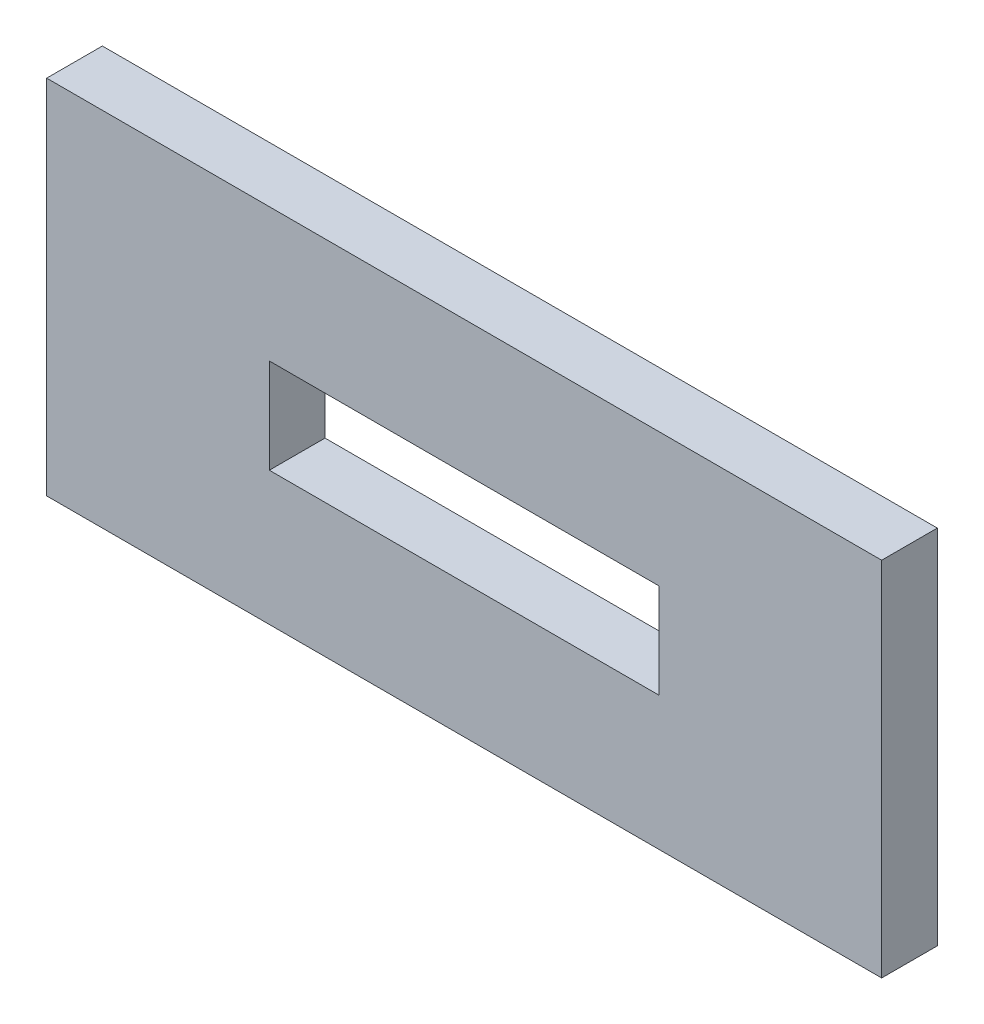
ISO-10303-21;
HEADER;
FILE_DESCRIPTION(('STEP AP214'),'2;1');
FILE_NAME('part.step','',(''),(''),'','','');
FILE_SCHEMA(('AUTOMOTIVE_DESIGN { 1 0 10303 214 1 1 1 1 }'));
ENDSEC;
DATA;
#1=APPLICATION_CONTEXT('core data for automotive mechanical design processes');
#2=APPLICATION_PROTOCOL_DEFINITION('international standard','automotive_design',2000,#1);
#3=PRODUCT_CONTEXT('',#1,'mechanical');
#4=PRODUCT('Part','Part','',(#3));
#5=PRODUCT_RELATED_PRODUCT_CATEGORY('part','',(#4));
#6=PRODUCT_DEFINITION_FORMATION('','',#4);
#7=PRODUCT_DEFINITION_CONTEXT('part definition',#1,'design');
#8=PRODUCT_DEFINITION('design','',#6,#7);
#9=PRODUCT_DEFINITION_SHAPE('','',#8);
#10=(LENGTH_UNIT() NAMED_UNIT(*) SI_UNIT(.MILLI.,.METRE.));
#11=(NAMED_UNIT(*) PLANE_ANGLE_UNIT() SI_UNIT($,.RADIAN.));
#12=(NAMED_UNIT(*) SI_UNIT($,.STERADIAN.) SOLID_ANGLE_UNIT());
#13=UNCERTAINTY_MEASURE_WITH_UNIT(LENGTH_MEASURE(1.E-05),#10,'distance_accuracy_value','');
#14=(GEOMETRIC_REPRESENTATION_CONTEXT(3) GLOBAL_UNCERTAINTY_ASSIGNED_CONTEXT((#13)) GLOBAL_UNIT_ASSIGNED_CONTEXT((#10,
#11,#12)) REPRESENTATION_CONTEXT('',''));
#15=CARTESIAN_POINT('',(0.,0.,0.));
#16=DIRECTION('',(0.,0.,1.));
#17=DIRECTION('',(1.,0.,0.));
#18=AXIS2_PLACEMENT_3D('',#15,#16,#17);
#19=CARTESIAN_POINT('',(0.,130.,0.));
#20=DIRECTION('',(-1.,0.,0.));
#21=DIRECTION('',(0.,0.,1.));
#22=AXIS2_PLACEMENT_3D('',#19,#20,#21);
#23=PLANE('',#22);
#24=DIRECTION('',(0.,0.,-1.));
#25=VECTOR('',#24,1.);
#26=CARTESIAN_POINT('',(0.,0.,0.));
#27=LINE('',#26,#25);
#28=CARTESIAN_POINT('',(0.,0.,20.));
#29=VERTEX_POINT('',#28);
#30=CARTESIAN_POINT('',(0.,0.,0.));
#31=VERTEX_POINT('',#30);
#32=EDGE_CURVE('E129',#29,#31,#27,.T.);
#33=ORIENTED_EDGE('',*,*,#32,.T.);
#34=DIRECTION('',(0.,-1.,0.));
#35=VECTOR('',#34,1.);
#36=CARTESIAN_POINT('',(0.,130.,0.));
#37=LINE('',#36,#35);
#38=CARTESIAN_POINT('',(0.,130.,0.));
#39=VERTEX_POINT('',#38);
#40=EDGE_CURVE('E11',#39,#31,#37,.T.);
#41=ORIENTED_EDGE('',*,*,#40,.F.);
#42=DIRECTION('',(0.,0.,-1.));
#43=VECTOR('',#42,1.);
#44=CARTESIAN_POINT('',(0.,130.,0.));
#45=LINE('',#44,#43);
#46=CARTESIAN_POINT('',(0.,130.,20.));
#47=VERTEX_POINT('',#46);
#48=EDGE_CURVE('E133',#47,#39,#45,.T.);
#49=ORIENTED_EDGE('',*,*,#48,.F.);
#50=DIRECTION('',(0.,-1.,0.));
#51=VECTOR('',#50,1.);
#52=CARTESIAN_POINT('',(0.,130.,20.));
#53=LINE('',#52,#51);
#54=EDGE_CURVE('E143',#47,#29,#53,.T.);
#55=ORIENTED_EDGE('',*,*,#54,.T.);
#56=EDGE_LOOP('',(#33,#41,#49,#55));
#57=FACE_BOUND('',#56,.T.);
#58=ADVANCED_FACE('F32',(#57),#23,.F.);
#59=CARTESIAN_POINT('',(0.,130.,0.));
#60=DIRECTION('',(0.,0.,1.));
#61=DIRECTION('',(1.,0.,0.));
#62=AXIS2_PLACEMENT_3D('',#59,#60,#61);
#63=PLANE('',#62);
#64=DIRECTION('',(1.,0.,0.));
#65=VECTOR('',#64,1.);
#66=CARTESIAN_POINT('',(-220.,48.,0.));
#67=LINE('',#66,#65);
#68=CARTESIAN_POINT('',(-220.,48.,0.));
#69=VERTEX_POINT('',#68);
#70=CARTESIAN_POINT('',(-80.,48.,0.));
#71=VERTEX_POINT('',#70);
#72=EDGE_CURVE('E104',#69,#71,#67,.T.);
#73=ORIENTED_EDGE('',*,*,#72,.T.);
#74=DIRECTION('',(0.,1.,0.));
#75=VECTOR('',#74,1.);
#76=CARTESIAN_POINT('',(-80.,48.,0.));
#77=LINE('',#76,#75);
#78=CARTESIAN_POINT('',(-80.,82.,0.));
#79=VERTEX_POINT('',#78);
#80=EDGE_CURVE('E98',#71,#79,#77,.T.);
#81=ORIENTED_EDGE('',*,*,#80,.T.);
#82=DIRECTION('',(-1.,0.,0.));
#83=VECTOR('',#82,1.);
#84=CARTESIAN_POINT('',(-220.,82.,0.));
#85=LINE('',#84,#83);
#86=CARTESIAN_POINT('',(-220.,82.,0.));
#87=VERTEX_POINT('',#86);
#88=EDGE_CURVE('E107',#79,#87,#85,.T.);
#89=ORIENTED_EDGE('',*,*,#88,.T.);
#90=DIRECTION('',(0.,-1.,0.));
#91=VECTOR('',#90,1.);
#92=CARTESIAN_POINT('',(-220.,48.,0.));
#93=LINE('',#92,#91);
#94=EDGE_CURVE('E46',#87,#69,#93,.T.);
#95=ORIENTED_EDGE('',*,*,#94,.T.);
#96=EDGE_LOOP('',(#73,#81,#89,#95));
#97=FACE_BOUND('',#96,.T.);
#98=DIRECTION('',(-1.,0.,0.));
#99=VECTOR('',#98,1.);
#100=CARTESIAN_POINT('',(0.,0.,0.));
#101=LINE('',#100,#99);
#102=CARTESIAN_POINT('',(-300.,0.,0.));
#103=VERTEX_POINT('',#102);
#104=EDGE_CURVE('E146',#31,#103,#101,.T.);
#105=ORIENTED_EDGE('',*,*,#104,.T.);
#106=DIRECTION('',(0.,-1.,0.));
#107=VECTOR('',#106,1.);
#108=CARTESIAN_POINT('',(-300.,130.,0.));
#109=LINE('',#108,#107);
#110=CARTESIAN_POINT('',(-300.,130.,0.));
#111=VERTEX_POINT('',#110);
#112=EDGE_CURVE('E39',#111,#103,#109,.T.);
#113=ORIENTED_EDGE('',*,*,#112,.F.);
#114=DIRECTION('',(-1.,0.,0.));
#115=VECTOR('',#114,1.);
#116=CARTESIAN_POINT('',(0.,130.,0.));
#117=LINE('',#116,#115);
#118=EDGE_CURVE('E136',#39,#111,#117,.T.);
#119=ORIENTED_EDGE('',*,*,#118,.F.);
#120=ORIENTED_EDGE('',*,*,#40,.T.);
#121=EDGE_LOOP('',(#105,#113,#119,#120));
#122=FACE_BOUND('',#121,.T.);
#123=ADVANCED_FACE('F111',(#97,#122),#63,.F.);
#124=CARTESIAN_POINT('',(-300.,130.,0.));
#125=DIRECTION('',(1.,0.,0.));
#126=DIRECTION('',(0.,0.,-1.));
#127=AXIS2_PLACEMENT_3D('',#124,#125,#126);
#128=PLANE('',#127);
#129=DIRECTION('',(0.,0.,1.));
#130=VECTOR('',#129,1.);
#131=CARTESIAN_POINT('',(-300.,0.,0.));
#132=LINE('',#131,#130);
#133=CARTESIAN_POINT('',(-300.,0.,20.0000000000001));
#134=VERTEX_POINT('',#133);
#135=EDGE_CURVE('E148',#103,#134,#132,.T.);
#136=ORIENTED_EDGE('',*,*,#135,.T.);
#137=DIRECTION('',(0.,-1.,0.));
#138=VECTOR('',#137,1.);
#139=CARTESIAN_POINT('',(-300.,130.,20.0000000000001));
#140=LINE('',#139,#138);
#141=CARTESIAN_POINT('',(-300.,130.,20.0000000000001));
#142=VERTEX_POINT('',#141);
#143=EDGE_CURVE('E153',#142,#134,#140,.T.);
#144=ORIENTED_EDGE('',*,*,#143,.F.);
#145=DIRECTION('',(0.,0.,1.));
#146=VECTOR('',#145,1.);
#147=CARTESIAN_POINT('',(-300.,130.,0.));
#148=LINE('',#147,#146);
#149=EDGE_CURVE('E139',#111,#142,#148,.T.);
#150=ORIENTED_EDGE('',*,*,#149,.F.);
#151=ORIENTED_EDGE('',*,*,#112,.T.);
#152=EDGE_LOOP('',(#136,#144,#150,#151));
#153=FACE_BOUND('',#152,.T.);
#154=ADVANCED_FACE('F160',(#153),#128,.F.);
#155=CARTESIAN_POINT('',(0.,130.,20.));
#156=DIRECTION('',(0.,0.,-1.));
#157=DIRECTION('',(-1.,0.,0.));
#158=AXIS2_PLACEMENT_3D('',#155,#156,#157);
#159=PLANE('',#158);
#160=DIRECTION('',(-1.,0.,0.));
#161=VECTOR('',#160,1.);
#162=CARTESIAN_POINT('',(-220.,82.,20.));
#163=LINE('',#162,#161);
#164=CARTESIAN_POINT('',(-80.,82.,20.));
#165=VERTEX_POINT('',#164);
#166=CARTESIAN_POINT('',(-220.,82.,20.));
#167=VERTEX_POINT('',#166);
#168=EDGE_CURVE('E123',#165,#167,#163,.T.);
#169=ORIENTED_EDGE('',*,*,#168,.F.);
#170=DIRECTION('',(0.,1.,0.));
#171=VECTOR('',#170,1.);
#172=CARTESIAN_POINT('',(-80.,48.,20.));
#173=LINE('',#172,#171);
#174=CARTESIAN_POINT('',(-80.,48.,20.));
#175=VERTEX_POINT('',#174);
#176=EDGE_CURVE('E54',#175,#165,#173,.T.);
#177=ORIENTED_EDGE('',*,*,#176,.F.);
#178=DIRECTION('',(1.,0.,0.));
#179=VECTOR('',#178,1.);
#180=CARTESIAN_POINT('',(-220.,48.,20.));
#181=LINE('',#180,#179);
#182=CARTESIAN_POINT('',(-220.,48.,20.));
#183=VERTEX_POINT('',#182);
#184=EDGE_CURVE('E114',#183,#175,#181,.T.);
#185=ORIENTED_EDGE('',*,*,#184,.F.);
#186=DIRECTION('',(0.,-1.,0.));
#187=VECTOR('',#186,1.);
#188=CARTESIAN_POINT('',(-220.,48.,20.));
#189=LINE('',#188,#187);
#190=EDGE_CURVE('E117',#167,#183,#189,.T.);
#191=ORIENTED_EDGE('',*,*,#190,.F.);
#192=EDGE_LOOP('',(#169,#177,#185,#191));
#193=FACE_BOUND('',#192,.T.);
#194=DIRECTION('',(1.,0.,0.));
#195=VECTOR('',#194,1.);
#196=CARTESIAN_POINT('',(0.,0.,20.));
#197=LINE('',#196,#195);
#198=EDGE_CURVE('E137',#134,#29,#197,.T.);
#199=ORIENTED_EDGE('',*,*,#198,.T.);
#200=ORIENTED_EDGE('',*,*,#54,.F.);
#201=DIRECTION('',(1.,0.,0.));
#202=VECTOR('',#201,1.);
#203=CARTESIAN_POINT('',(0.,130.,20.));
#204=LINE('',#203,#202);
#205=EDGE_CURVE('E141',#142,#47,#204,.T.);
#206=ORIENTED_EDGE('',*,*,#205,.F.);
#207=ORIENTED_EDGE('',*,*,#143,.T.);
#208=EDGE_LOOP('',(#199,#200,#206,#207));
#209=FACE_BOUND('',#208,.T.);
#210=ADVANCED_FACE('F168',(#193,#209),#159,.F.);
#211=CARTESIAN_POINT('',(0.,130.,0.));
#212=DIRECTION('',(0.,-1.,0.));
#213=DIRECTION('',(0.,0.,-1.));
#214=AXIS2_PLACEMENT_3D('',#211,#212,#213);
#215=PLANE('',#214);
#216=ORIENTED_EDGE('',*,*,#48,.T.);
#217=ORIENTED_EDGE('',*,*,#118,.T.);
#218=ORIENTED_EDGE('',*,*,#149,.T.);
#219=ORIENTED_EDGE('',*,*,#205,.T.);
#220=EDGE_LOOP('',(#216,#217,#218,#219));
#221=FACE_BOUND('',#220,.T.);
#222=ADVANCED_FACE('F174',(#221),#215,.F.);
#223=CARTESIAN_POINT('',(0.,0.,0.));
#224=DIRECTION('',(0.,-1.,0.));
#225=DIRECTION('',(0.,0.,-1.));
#226=AXIS2_PLACEMENT_3D('',#223,#224,#225);
#227=PLANE('',#226);
#228=ORIENTED_EDGE('',*,*,#32,.F.);
#229=ORIENTED_EDGE('',*,*,#198,.F.);
#230=ORIENTED_EDGE('',*,*,#135,.F.);
#231=ORIENTED_EDGE('',*,*,#104,.F.);
#232=EDGE_LOOP('',(#228,#229,#230,#231));
#233=FACE_BOUND('',#232,.T.);
#234=ADVANCED_FACE('F165',(#233),#227,.T.);
#235=CARTESIAN_POINT('',(-80.,48.,0.));
#236=DIRECTION('',(1.,0.,0.));
#237=DIRECTION('',(0.,0.,-1.));
#238=AXIS2_PLACEMENT_3D('',#235,#236,#237);
#239=PLANE('',#238);
#240=ORIENTED_EDGE('',*,*,#176,.T.);
#241=DIRECTION('',(0.,0.,1.));
#242=VECTOR('',#241,1.);
#243=CARTESIAN_POINT('',(-80.,82.,0.));
#244=LINE('',#243,#242);
#245=EDGE_CURVE('E94',#79,#165,#244,.T.);
#246=ORIENTED_EDGE('',*,*,#245,.F.);
#247=ORIENTED_EDGE('',*,*,#80,.F.);
#248=DIRECTION('',(0.,0.,1.));
#249=VECTOR('',#248,1.);
#250=CARTESIAN_POINT('',(-80.,48.,0.));
#251=LINE('',#250,#249);
#252=EDGE_CURVE('E127',#71,#175,#251,.T.);
#253=ORIENTED_EDGE('',*,*,#252,.T.);
#254=EDGE_LOOP('',(#240,#246,#247,#253));
#255=FACE_BOUND('',#254,.T.);
#256=ADVANCED_FACE('F96',(#255),#239,.F.);
#257=CARTESIAN_POINT('',(-220.,48.,0.));
#258=DIRECTION('',(0.,-1.,0.));
#259=DIRECTION('',(0.,0.,-1.));
#260=AXIS2_PLACEMENT_3D('',#257,#258,#259);
#261=PLANE('',#260);
#262=ORIENTED_EDGE('',*,*,#184,.T.);
#263=ORIENTED_EDGE('',*,*,#252,.F.);
#264=ORIENTED_EDGE('',*,*,#72,.F.);
#265=DIRECTION('',(0.,0.,1.));
#266=VECTOR('',#265,1.);
#267=CARTESIAN_POINT('',(-220.,48.,0.));
#268=LINE('',#267,#266);
#269=EDGE_CURVE('E130',#69,#183,#268,.T.);
#270=ORIENTED_EDGE('',*,*,#269,.T.);
#271=EDGE_LOOP('',(#262,#263,#264,#270));
#272=FACE_BOUND('',#271,.T.);
#273=ADVANCED_FACE('F191',(#272),#261,.F.);
#274=CARTESIAN_POINT('',(-220.,48.,0.));
#275=DIRECTION('',(-1.,0.,0.));
#276=DIRECTION('',(0.,0.,1.));
#277=AXIS2_PLACEMENT_3D('',#274,#275,#276);
#278=PLANE('',#277);
#279=ORIENTED_EDGE('',*,*,#190,.T.);
#280=ORIENTED_EDGE('',*,*,#269,.F.);
#281=ORIENTED_EDGE('',*,*,#94,.F.);
#282=DIRECTION('',(0.,0.,1.));
#283=VECTOR('',#282,1.);
#284=CARTESIAN_POINT('',(-220.,82.,0.));
#285=LINE('',#284,#283);
#286=EDGE_CURVE('E103',#87,#167,#285,.T.);
#287=ORIENTED_EDGE('',*,*,#286,.T.);
#288=EDGE_LOOP('',(#279,#280,#281,#287));
#289=FACE_BOUND('',#288,.T.);
#290=ADVANCED_FACE('F194',(#289),#278,.F.);
#291=CARTESIAN_POINT('',(-220.,82.,0.));
#292=DIRECTION('',(0.,1.,0.));
#293=DIRECTION('',(0.,0.,1.));
#294=AXIS2_PLACEMENT_3D('',#291,#292,#293);
#295=PLANE('',#294);
#296=ORIENTED_EDGE('',*,*,#168,.T.);
#297=ORIENTED_EDGE('',*,*,#286,.F.);
#298=ORIENTED_EDGE('',*,*,#88,.F.);
#299=ORIENTED_EDGE('',*,*,#245,.T.);
#300=EDGE_LOOP('',(#296,#297,#298,#299));
#301=FACE_BOUND('',#300,.T.);
#302=ADVANCED_FACE('F108',(#301),#295,.F.);
#303=CLOSED_SHELL('',(#58,#123,#154,#210,#222,#234,#256,#273,#290,#302));
#304=MANIFOLD_SOLID_BREP('B2',#303);
#305=ADVANCED_BREP_SHAPE_REPRESENTATION('',(#18,#304),#14);
#306=SHAPE_DEFINITION_REPRESENTATION(#9,#305);
ENDSEC;
END-ISO-10303-21;
